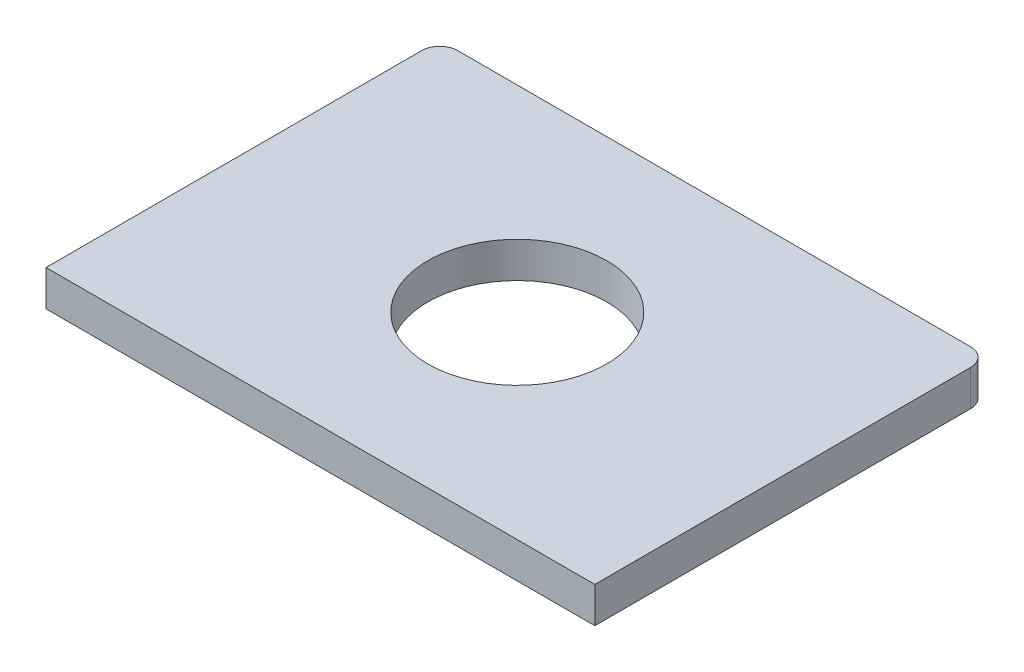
ISO-10303-21;
HEADER;
FILE_DESCRIPTION(('STEP AP214'),'2;1');
FILE_NAME('part.step','',(''),(''),'','','');
FILE_SCHEMA(('AUTOMOTIVE_DESIGN { 1 0 10303 214 1 1 1 1 }'));
ENDSEC;
DATA;
#1=APPLICATION_CONTEXT('core data for automotive mechanical design processes');
#2=APPLICATION_PROTOCOL_DEFINITION('international standard','automotive_design',2000,#1);
#3=PRODUCT_CONTEXT('',#1,'mechanical');
#4=PRODUCT('Part','Part','',(#3));
#5=PRODUCT_RELATED_PRODUCT_CATEGORY('part','',(#4));
#6=PRODUCT_DEFINITION_FORMATION('','',#4);
#7=PRODUCT_DEFINITION_CONTEXT('part definition',#1,'design');
#8=PRODUCT_DEFINITION('design','',#6,#7);
#9=PRODUCT_DEFINITION_SHAPE('','',#8);
#10=(LENGTH_UNIT() NAMED_UNIT(*) SI_UNIT(.MILLI.,.METRE.));
#11=(NAMED_UNIT(*) PLANE_ANGLE_UNIT() SI_UNIT($,.RADIAN.));
#12=(NAMED_UNIT(*) SI_UNIT($,.STERADIAN.) SOLID_ANGLE_UNIT());
#13=UNCERTAINTY_MEASURE_WITH_UNIT(LENGTH_MEASURE(1.E-05),#10,'distance_accuracy_value','');
#14=(GEOMETRIC_REPRESENTATION_CONTEXT(3) GLOBAL_UNCERTAINTY_ASSIGNED_CONTEXT((#13)) GLOBAL_UNIT_ASSIGNED_CONTEXT((#10,
#11,#12)) REPRESENTATION_CONTEXT('',''));
#15=CARTESIAN_POINT('',(0.,0.,0.));
#16=DIRECTION('',(0.,0.,1.));
#17=DIRECTION('',(1.,0.,0.));
#18=AXIS2_PLACEMENT_3D('',#15,#16,#17);
#19=CARTESIAN_POINT('',(0.,245.,0.));
#20=DIRECTION('',(0.,1.,0.));
#21=DIRECTION('',(0.,0.,1.));
#22=AXIS2_PLACEMENT_3D('',#19,#20,#21);
#23=PLANE('',#22);
#24=CARTESIAN_POINT('',(0.,245.,0.));
#25=DIRECTION('',(0.,1.,0.));
#26=DIRECTION('',(0.,0.,1.));
#27=AXIS2_PLACEMENT_3D('',#24,#25,#26);
#28=CIRCLE('',#27,75.);
#29=CARTESIAN_POINT('',(0.,245.,75.));
#30=VERTEX_POINT('',#29);
#31=EDGE_CURVE('E162',#30,#30,#28,.T.);
#32=ORIENTED_EDGE('',*,*,#31,.F.);
#33=EDGE_LOOP('',(#32));
#34=FACE_BOUND('',#33,.T.);
#35=DIRECTION('',(-1.,0.,0.));
#36=VECTOR('',#35,1.);
#37=CARTESIAN_POINT('',(0.,245.,-165.));
#38=LINE('',#37,#36);
#39=CARTESIAN_POINT('',(215.,245.,-165.));
#40=VERTEX_POINT('',#39);
#41=CARTESIAN_POINT('',(-215.,245.,-165.));
#42=VERTEX_POINT('',#41);
#43=EDGE_CURVE('E173',#40,#42,#38,.T.);
#44=ORIENTED_EDGE('',*,*,#43,.T.);
#45=CARTESIAN_POINT('',(-215.,245.,-150.));
#46=DIRECTION('',(0.,1.,0.));
#47=DIRECTION('',(0.,0.,1.));
#48=AXIS2_PLACEMENT_3D('',#45,#46,#47);
#49=CIRCLE('',#48,15.);
#50=CARTESIAN_POINT('',(-230.,245.,-150.));
#51=VERTEX_POINT('',#50);
#52=EDGE_CURVE('E205',#42,#51,#49,.T.);
#53=ORIENTED_EDGE('',*,*,#52,.T.);
#54=DIRECTION('',(0.,0.,1.));
#55=VECTOR('',#54,1.);
#56=CARTESIAN_POINT('',(-230.,245.,0.));
#57=LINE('',#56,#55);
#58=CARTESIAN_POINT('',(-230.,245.,165.));
#59=VERTEX_POINT('',#58);
#60=EDGE_CURVE('E176',#51,#59,#57,.T.);
#61=ORIENTED_EDGE('',*,*,#60,.T.);
#62=DIRECTION('',(1.,0.,0.));
#63=VECTOR('',#62,1.);
#64=CARTESIAN_POINT('',(0.,245.,165.));
#65=LINE('',#64,#63);
#66=CARTESIAN_POINT('',(230.,245.,165.));
#67=VERTEX_POINT('',#66);
#68=EDGE_CURVE('E179',#59,#67,#65,.T.);
#69=ORIENTED_EDGE('',*,*,#68,.T.);
#70=DIRECTION('',(0.,0.,1.));
#71=VECTOR('',#70,1.);
#72=CARTESIAN_POINT('',(230.,245.,0.));
#73=LINE('',#72,#71);
#74=CARTESIAN_POINT('',(230.,245.,-150.));
#75=VERTEX_POINT('',#74);
#76=EDGE_CURVE('E182',#75,#67,#73,.T.);
#77=ORIENTED_EDGE('',*,*,#76,.F.);
#78=CARTESIAN_POINT('',(215.,245.,-150.));
#79=DIRECTION('',(0.,1.,0.));
#80=DIRECTION('',(0.,0.,1.));
#81=AXIS2_PLACEMENT_3D('',#78,#79,#80);
#82=CIRCLE('',#81,15.);
#83=EDGE_CURVE('E203',#75,#40,#82,.T.);
#84=ORIENTED_EDGE('',*,*,#83,.T.);
#85=EDGE_LOOP('',(#44,#53,#61,#69,#77,#84));
#86=FACE_BOUND('',#85,.T.);
#87=ADVANCED_FACE('F38',(#34,#86),#23,.T.);
#88=CARTESIAN_POINT('',(0.,245.,-165.));
#89=DIRECTION('',(0.,0.,1.));
#90=DIRECTION('',(1.,0.,0.));
#91=AXIS2_PLACEMENT_3D('',#88,#89,#90);
#92=PLANE('',#91);
#93=DIRECTION('',(-1.,0.,0.));
#94=VECTOR('',#93,1.);
#95=CARTESIAN_POINT('',(0.,215.,-165.));
#96=LINE('',#95,#94);
#97=CARTESIAN_POINT('',(215.,215.,-165.));
#98=VERTEX_POINT('',#97);
#99=CARTESIAN_POINT('',(-215.,215.,-165.));
#100=VERTEX_POINT('',#99);
#101=EDGE_CURVE('E170',#98,#100,#96,.T.);
#102=ORIENTED_EDGE('',*,*,#101,.T.);
#103=DIRECTION('',(0.,1.,0.));
#104=VECTOR('',#103,1.);
#105=CARTESIAN_POINT('',(-215.,245.,-165.));
#106=LINE('',#105,#104);
#107=EDGE_CURVE('E200',#100,#42,#106,.T.);
#108=ORIENTED_EDGE('',*,*,#107,.T.);
#109=ORIENTED_EDGE('',*,*,#43,.F.);
#110=DIRECTION('',(0.,1.,0.));
#111=VECTOR('',#110,1.);
#112=CARTESIAN_POINT('',(215.,215.,-165.));
#113=LINE('',#112,#111);
#114=EDGE_CURVE('E198',#40,#98,#113,.F.);
#115=ORIENTED_EDGE('',*,*,#114,.T.);
#116=EDGE_LOOP('',(#102,#108,#109,#115));
#117=FACE_BOUND('',#116,.T.);
#118=ADVANCED_FACE('F214',(#117),#92,.F.);
#119=CARTESIAN_POINT('',(-230.,245.,0.));
#120=DIRECTION('',(1.,0.,0.));
#121=DIRECTION('',(0.,0.,-1.));
#122=AXIS2_PLACEMENT_3D('',#119,#120,#121);
#123=PLANE('',#122);
#124=ORIENTED_EDGE('',*,*,#60,.F.);
#125=DIRECTION('',(0.,1.,0.));
#126=VECTOR('',#125,1.);
#127=CARTESIAN_POINT('',(-230.,245.,-150.));
#128=LINE('',#127,#126);
#129=CARTESIAN_POINT('',(-230.,215.,-150.));
#130=VERTEX_POINT('',#129);
#131=EDGE_CURVE('E62',#51,#130,#128,.F.);
#132=ORIENTED_EDGE('',*,*,#131,.T.);
#133=DIRECTION('',(0.,0.,1.));
#134=VECTOR('',#133,1.);
#135=CARTESIAN_POINT('',(-230.,215.,0.));
#136=LINE('',#135,#134);
#137=CARTESIAN_POINT('',(-230.,215.,165.));
#138=VERTEX_POINT('',#137);
#139=EDGE_CURVE('E187',#130,#138,#136,.T.);
#140=ORIENTED_EDGE('',*,*,#139,.T.);
#141=DIRECTION('',(0.,-1.,0.));
#142=VECTOR('',#141,1.);
#143=CARTESIAN_POINT('',(-230.,245.,165.));
#144=LINE('',#143,#142);
#145=EDGE_CURVE('E195',#59,#138,#144,.T.);
#146=ORIENTED_EDGE('',*,*,#145,.F.);
#147=EDGE_LOOP('',(#124,#132,#140,#146));
#148=FACE_BOUND('',#147,.T.);
#149=ADVANCED_FACE('F220',(#148),#123,.F.);
#150=CARTESIAN_POINT('',(0.,245.,165.));
#151=DIRECTION('',(0.,0.,-1.));
#152=DIRECTION('',(-1.,0.,0.));
#153=AXIS2_PLACEMENT_3D('',#150,#151,#152);
#154=PLANE('',#153);
#155=DIRECTION('',(1.,0.,0.));
#156=VECTOR('',#155,1.);
#157=CARTESIAN_POINT('',(0.,215.,165.));
#158=LINE('',#157,#156);
#159=CARTESIAN_POINT('',(230.,215.,165.));
#160=VERTEX_POINT('',#159);
#161=EDGE_CURVE('E189',#138,#160,#158,.T.);
#162=ORIENTED_EDGE('',*,*,#161,.T.);
#163=DIRECTION('',(0.,-1.,0.));
#164=VECTOR('',#163,1.);
#165=CARTESIAN_POINT('',(230.,245.,165.));
#166=LINE('',#165,#164);
#167=EDGE_CURVE('E184',#67,#160,#166,.T.);
#168=ORIENTED_EDGE('',*,*,#167,.F.);
#169=ORIENTED_EDGE('',*,*,#68,.F.);
#170=ORIENTED_EDGE('',*,*,#145,.T.);
#171=EDGE_LOOP('',(#162,#168,#169,#170));
#172=FACE_BOUND('',#171,.T.);
#173=ADVANCED_FACE('F224',(#172),#154,.F.);
#174=CARTESIAN_POINT('',(230.,245.,0.));
#175=DIRECTION('',(1.,0.,0.));
#176=DIRECTION('',(0.,0.,-1.));
#177=AXIS2_PLACEMENT_3D('',#174,#175,#176);
#178=PLANE('',#177);
#179=DIRECTION('',(0.,0.,1.));
#180=VECTOR('',#179,1.);
#181=CARTESIAN_POINT('',(230.,215.,0.));
#182=LINE('',#181,#180);
#183=CARTESIAN_POINT('',(230.,215.,-150.));
#184=VERTEX_POINT('',#183);
#185=EDGE_CURVE('E177',#184,#160,#182,.T.);
#186=ORIENTED_EDGE('',*,*,#185,.F.);
#187=DIRECTION('',(0.,1.,0.));
#188=VECTOR('',#187,1.);
#189=CARTESIAN_POINT('',(230.,245.,-150.));
#190=LINE('',#189,#188);
#191=EDGE_CURVE('E11',#184,#75,#190,.T.);
#192=ORIENTED_EDGE('',*,*,#191,.T.);
#193=ORIENTED_EDGE('',*,*,#76,.T.);
#194=ORIENTED_EDGE('',*,*,#167,.T.);
#195=EDGE_LOOP('',(#186,#192,#193,#194));
#196=FACE_BOUND('',#195,.T.);
#197=ADVANCED_FACE('F227',(#196),#178,.T.);
#198=CARTESIAN_POINT('',(0.,215.,0.));
#199=DIRECTION('',(0.,1.,0.));
#200=DIRECTION('',(0.,0.,1.));
#201=AXIS2_PLACEMENT_3D('',#198,#199,#200);
#202=PLANE('',#201);
#203=CARTESIAN_POINT('',(0.,215.,0.));
#204=DIRECTION('',(0.,1.,0.));
#205=DIRECTION('',(0.,0.,1.));
#206=AXIS2_PLACEMENT_3D('',#203,#204,#205);
#207=CIRCLE('',#206,75.);
#208=CARTESIAN_POINT('',(0.,215.,75.));
#209=VERTEX_POINT('',#208);
#210=EDGE_CURVE('E167',#209,#209,#207,.T.);
#211=ORIENTED_EDGE('',*,*,#210,.T.);
#212=EDGE_LOOP('',(#211));
#213=FACE_BOUND('',#212,.T.);
#214=ORIENTED_EDGE('',*,*,#139,.F.);
#215=CARTESIAN_POINT('',(-215.,215.,-150.));
#216=DIRECTION('',(0.,1.,0.));
#217=DIRECTION('',(0.,0.,1.));
#218=AXIS2_PLACEMENT_3D('',#215,#216,#217);
#219=CIRCLE('',#218,15.);
#220=EDGE_CURVE('E47',#130,#100,#219,.F.);
#221=ORIENTED_EDGE('',*,*,#220,.T.);
#222=ORIENTED_EDGE('',*,*,#101,.F.);
#223=CARTESIAN_POINT('',(215.,215.,-150.));
#224=DIRECTION('',(0.,1.,0.));
#225=DIRECTION('',(0.,0.,1.));
#226=AXIS2_PLACEMENT_3D('',#223,#224,#225);
#227=CIRCLE('',#226,15.);
#228=EDGE_CURVE('E54',#98,#184,#227,.F.);
#229=ORIENTED_EDGE('',*,*,#228,.T.);
#230=ORIENTED_EDGE('',*,*,#185,.T.);
#231=ORIENTED_EDGE('',*,*,#161,.F.);
#232=EDGE_LOOP('',(#214,#221,#222,#229,#230,#231));
#233=FACE_BOUND('',#232,.T.);
#234=ADVANCED_FACE('F209',(#213,#233),#202,.F.);
#235=CARTESIAN_POINT('',(0.,215.,0.));
#236=DIRECTION('',(0.,1.,0.));
#237=DIRECTION('',(0.,0.,1.));
#238=AXIS2_PLACEMENT_3D('',#235,#236,#237);
#239=CYLINDRICAL_SURFACE('',#238,75.);
#240=ORIENTED_EDGE('',*,*,#210,.F.);
#241=EDGE_LOOP('',(#240));
#242=FACE_BOUND('',#241,.T.);
#243=ORIENTED_EDGE('',*,*,#31,.T.);
#244=EDGE_LOOP('',(#243));
#245=FACE_BOUND('',#244,.T.);
#246=ADVANCED_FACE('F235',(#242,#245),#239,.F.);
#247=CARTESIAN_POINT('',(-215.,245.,-150.));
#248=DIRECTION('',(0.,1.,0.));
#249=DIRECTION('',(0.,0.,1.));
#250=AXIS2_PLACEMENT_3D('',#247,#248,#249);
#251=CYLINDRICAL_SURFACE('',#250,15.);
#252=ORIENTED_EDGE('',*,*,#220,.F.);
#253=ORIENTED_EDGE('',*,*,#131,.F.);
#254=ORIENTED_EDGE('',*,*,#52,.F.);
#255=ORIENTED_EDGE('',*,*,#107,.F.);
#256=EDGE_LOOP('',(#252,#253,#254,#255));
#257=FACE_BOUND('',#256,.T.);
#258=ADVANCED_FACE('F217',(#257),#251,.T.);
#259=CARTESIAN_POINT('',(215.,245.,-150.));
#260=DIRECTION('',(0.,-1.,0.));
#261=DIRECTION('',(0.,0.,-1.));
#262=AXIS2_PLACEMENT_3D('',#259,#260,#261);
#263=CYLINDRICAL_SURFACE('',#262,15.);
#264=ORIENTED_EDGE('',*,*,#228,.F.);
#265=ORIENTED_EDGE('',*,*,#114,.F.);
#266=ORIENTED_EDGE('',*,*,#83,.F.);
#267=ORIENTED_EDGE('',*,*,#191,.F.);
#268=EDGE_LOOP('',(#264,#265,#266,#267));
#269=FACE_BOUND('',#268,.T.);
#270=ADVANCED_FACE('F40',(#269),#263,.T.);
#271=CLOSED_SHELL('',(#87,#118,#149,#173,#197,#234,#246,#258,#270));
#272=CARTESIAN_POINT('',(0.,0.,160.));
#273=DIRECTION('',(0.,0.,1.));
#274=DIRECTION('',(1.,0.,0.));
#275=AXIS2_PLACEMENT_3D('',#272,#273,#274);
#276=PLANE('',#275);
#277=DIRECTION('',(0.,-1.,0.));
#278=VECTOR('',#277,1.);
#279=CARTESIAN_POINT('',(-225.,240.,160.));
#280=LINE('',#279,#278);
#281=CARTESIAN_POINT('',(-225.,240.,160.));
#282=VERTEX_POINT('',#281);
#283=CARTESIAN_POINT('',(-225.,220.,160.));
#284=VERTEX_POINT('',#283);
#285=EDGE_CURVE('E133',#282,#284,#280,.T.);
#286=ORIENTED_EDGE('',*,*,#285,.F.);
#287=DIRECTION('',(-1.,0.,0.));
#288=VECTOR('',#287,1.);
#289=CARTESIAN_POINT('',(-225.,240.,160.));
#290=LINE('',#289,#288);
#291=CARTESIAN_POINT('',(225.,240.,160.));
#292=VERTEX_POINT('',#291);
#293=EDGE_CURVE('E143',#292,#282,#290,.T.);
#294=ORIENTED_EDGE('',*,*,#293,.F.);
#295=DIRECTION('',(0.,1.,0.));
#296=VECTOR('',#295,1.);
#297=CARTESIAN_POINT('',(225.,240.,160.));
#298=LINE('',#297,#296);
#299=CARTESIAN_POINT('',(225.,220.,160.));
#300=VERTEX_POINT('',#299);
#301=EDGE_CURVE('E141',#300,#292,#298,.T.);
#302=ORIENTED_EDGE('',*,*,#301,.F.);
#303=DIRECTION('',(1.,0.,0.));
#304=VECTOR('',#303,1.);
#305=CARTESIAN_POINT('',(-225.,220.,160.));
#306=LINE('',#305,#304);
#307=EDGE_CURVE('E121',#284,#300,#306,.T.);
#308=ORIENTED_EDGE('',*,*,#307,.F.);
#309=EDGE_LOOP('',(#286,#294,#302,#308));
#310=FACE_BOUND('',#309,.T.);
#311=ADVANCED_FACE('F140',(#310),#276,.F.);
#312=CARTESIAN_POINT('',(0.,245.,-160.));
#313=DIRECTION('',(0.,0.,1.));
#314=DIRECTION('',(1.,0.,0.));
#315=AXIS2_PLACEMENT_3D('',#312,#313,#314);
#316=PLANE('',#315);
#317=DIRECTION('',(-1.,0.,0.));
#318=VECTOR('',#317,1.);
#319=CARTESIAN_POINT('',(0.,220.,-160.));
#320=LINE('',#319,#318);
#321=CARTESIAN_POINT('',(225.,220.,-160.));
#322=VERTEX_POINT('',#321);
#323=CARTESIAN_POINT('',(-225.,220.,-160.));
#324=VERTEX_POINT('',#323);
#325=EDGE_CURVE('E124',#322,#324,#320,.T.);
#326=ORIENTED_EDGE('',*,*,#325,.F.);
#327=DIRECTION('',(0.,1.,0.));
#328=VECTOR('',#327,1.);
#329=CARTESIAN_POINT('',(225.,245.,-160.));
#330=LINE('',#329,#328);
#331=CARTESIAN_POINT('',(225.,240.,-160.));
#332=VERTEX_POINT('',#331);
#333=EDGE_CURVE('E156',#322,#332,#330,.T.);
#334=ORIENTED_EDGE('',*,*,#333,.T.);
#335=DIRECTION('',(-1.,0.,0.));
#336=VECTOR('',#335,1.);
#337=CARTESIAN_POINT('',(0.,240.,-160.));
#338=LINE('',#337,#336);
#339=CARTESIAN_POINT('',(-225.,240.,-160.));
#340=VERTEX_POINT('',#339);
#341=EDGE_CURVE('E129',#332,#340,#338,.T.);
#342=ORIENTED_EDGE('',*,*,#341,.T.);
#343=DIRECTION('',(0.,1.,0.));
#344=VECTOR('',#343,1.);
#345=CARTESIAN_POINT('',(-225.,245.,-160.));
#346=LINE('',#345,#344);
#347=EDGE_CURVE('E154',#324,#340,#346,.T.);
#348=ORIENTED_EDGE('',*,*,#347,.F.);
#349=EDGE_LOOP('',(#326,#334,#342,#348));
#350=FACE_BOUND('',#349,.T.);
#351=ADVANCED_FACE('F274',(#350),#316,.T.);
#352=CARTESIAN_POINT('',(0.,215.,0.));
#353=DIRECTION('',(0.,1.,0.));
#354=DIRECTION('',(0.,0.,1.));
#355=AXIS2_PLACEMENT_3D('',#352,#353,#354);
#356=CYLINDRICAL_SURFACE('',#355,80.);
#357=CARTESIAN_POINT('',(0.,220.,0.));
#358=DIRECTION('',(0.,1.,0.));
#359=DIRECTION('',(0.,0.,1.));
#360=AXIS2_PLACEMENT_3D('',#357,#358,#359);
#361=CIRCLE('',#360,80.);
#362=CARTESIAN_POINT('',(0.,220.,80.));
#363=VERTEX_POINT('',#362);
#364=EDGE_CURVE('E150',#363,#363,#361,.T.);
#365=ORIENTED_EDGE('',*,*,#364,.T.);
#366=EDGE_LOOP('',(#365));
#367=FACE_BOUND('',#366,.T.);
#368=CARTESIAN_POINT('',(0.,240.,0.));
#369=DIRECTION('',(0.,1.,0.));
#370=DIRECTION('',(0.,0.,1.));
#371=AXIS2_PLACEMENT_3D('',#368,#369,#370);
#372=CIRCLE('',#371,80.);
#373=CARTESIAN_POINT('',(0.,240.,80.));
#374=VERTEX_POINT('',#373);
#375=EDGE_CURVE('E147',#374,#374,#372,.T.);
#376=ORIENTED_EDGE('',*,*,#375,.F.);
#377=EDGE_LOOP('',(#376));
#378=FACE_BOUND('',#377,.T.);
#379=ADVANCED_FACE('F264',(#367,#378),#356,.T.);
#380=CARTESIAN_POINT('',(-225.,220.,163.));
#381=DIRECTION('',(0.,-1.,0.));
#382=DIRECTION('',(0.,0.,-1.));
#383=AXIS2_PLACEMENT_3D('',#380,#381,#382);
#384=PLANE('',#383);
#385=ORIENTED_EDGE('',*,*,#364,.F.);
#386=EDGE_LOOP('',(#385));
#387=FACE_BOUND('',#386,.T.);
#388=ORIENTED_EDGE('',*,*,#307,.T.);
#389=DIRECTION('',(0.,0.,1.));
#390=VECTOR('',#389,1.);
#391=CARTESIAN_POINT('',(225.,220.,163.));
#392=LINE('',#391,#390);
#393=EDGE_CURVE('E128',#322,#300,#392,.T.);
#394=ORIENTED_EDGE('',*,*,#393,.F.);
#395=ORIENTED_EDGE('',*,*,#325,.T.);
#396=DIRECTION('',(0.,0.,1.));
#397=VECTOR('',#396,1.);
#398=CARTESIAN_POINT('',(-225.,220.,163.));
#399=LINE('',#398,#397);
#400=EDGE_CURVE('E117',#324,#284,#399,.T.);
#401=ORIENTED_EDGE('',*,*,#400,.T.);
#402=EDGE_LOOP('',(#388,#394,#395,#401));
#403=FACE_BOUND('',#402,.T.);
#404=ADVANCED_FACE('F119',(#387,#403),#384,.F.);
#405=CARTESIAN_POINT('',(225.,240.,163.));
#406=DIRECTION('',(1.,0.,0.));
#407=DIRECTION('',(0.,0.,-1.));
#408=AXIS2_PLACEMENT_3D('',#405,#406,#407);
#409=PLANE('',#408);
#410=ORIENTED_EDGE('',*,*,#301,.T.);
#411=DIRECTION('',(0.,0.,1.));
#412=VECTOR('',#411,1.);
#413=CARTESIAN_POINT('',(225.,240.,163.));
#414=LINE('',#413,#412);
#415=EDGE_CURVE('E163',#332,#292,#414,.T.);
#416=ORIENTED_EDGE('',*,*,#415,.F.);
#417=ORIENTED_EDGE('',*,*,#333,.F.);
#418=ORIENTED_EDGE('',*,*,#393,.T.);
#419=EDGE_LOOP('',(#410,#416,#417,#418));
#420=FACE_BOUND('',#419,.T.);
#421=ADVANCED_FACE('F263',(#420),#409,.F.);
#422=CARTESIAN_POINT('',(-225.,240.,163.));
#423=DIRECTION('',(0.,1.,0.));
#424=DIRECTION('',(0.,0.,1.));
#425=AXIS2_PLACEMENT_3D('',#422,#423,#424);
#426=PLANE('',#425);
#427=ORIENTED_EDGE('',*,*,#375,.T.);
#428=EDGE_LOOP('',(#427));
#429=FACE_BOUND('',#428,.T.);
#430=ORIENTED_EDGE('',*,*,#293,.T.);
#431=DIRECTION('',(0.,0.,1.));
#432=VECTOR('',#431,1.);
#433=CARTESIAN_POINT('',(-225.,240.,163.));
#434=LINE('',#433,#432);
#435=EDGE_CURVE('E135',#340,#282,#434,.T.);
#436=ORIENTED_EDGE('',*,*,#435,.F.);
#437=ORIENTED_EDGE('',*,*,#341,.F.);
#438=ORIENTED_EDGE('',*,*,#415,.T.);
#439=EDGE_LOOP('',(#430,#436,#437,#438));
#440=FACE_BOUND('',#439,.T.);
#441=ADVANCED_FACE('F259',(#429,#440),#426,.F.);
#442=CARTESIAN_POINT('',(-225.,240.,163.));
#443=DIRECTION('',(-1.,0.,0.));
#444=DIRECTION('',(0.,0.,1.));
#445=AXIS2_PLACEMENT_3D('',#442,#443,#444);
#446=PLANE('',#445);
#447=ORIENTED_EDGE('',*,*,#285,.T.);
#448=ORIENTED_EDGE('',*,*,#400,.F.);
#449=ORIENTED_EDGE('',*,*,#347,.T.);
#450=ORIENTED_EDGE('',*,*,#435,.T.);
#451=EDGE_LOOP('',(#447,#448,#449,#450));
#452=FACE_BOUND('',#451,.T.);
#453=ADVANCED_FACE('F134',(#452),#446,.F.);
#454=CLOSED_SHELL('',(#311,#351,#379,#404,#421,#441,#453));
#455=ORIENTED_CLOSED_SHELL('',*,#454,.T.);
#456=BREP_WITH_VOIDS('B2',#271,(#455));
#457=ADVANCED_BREP_SHAPE_REPRESENTATION('',(#18,#456),#14);
#458=SHAPE_DEFINITION_REPRESENTATION(#9,#457);
ENDSEC;
END-ISO-10303-21;
